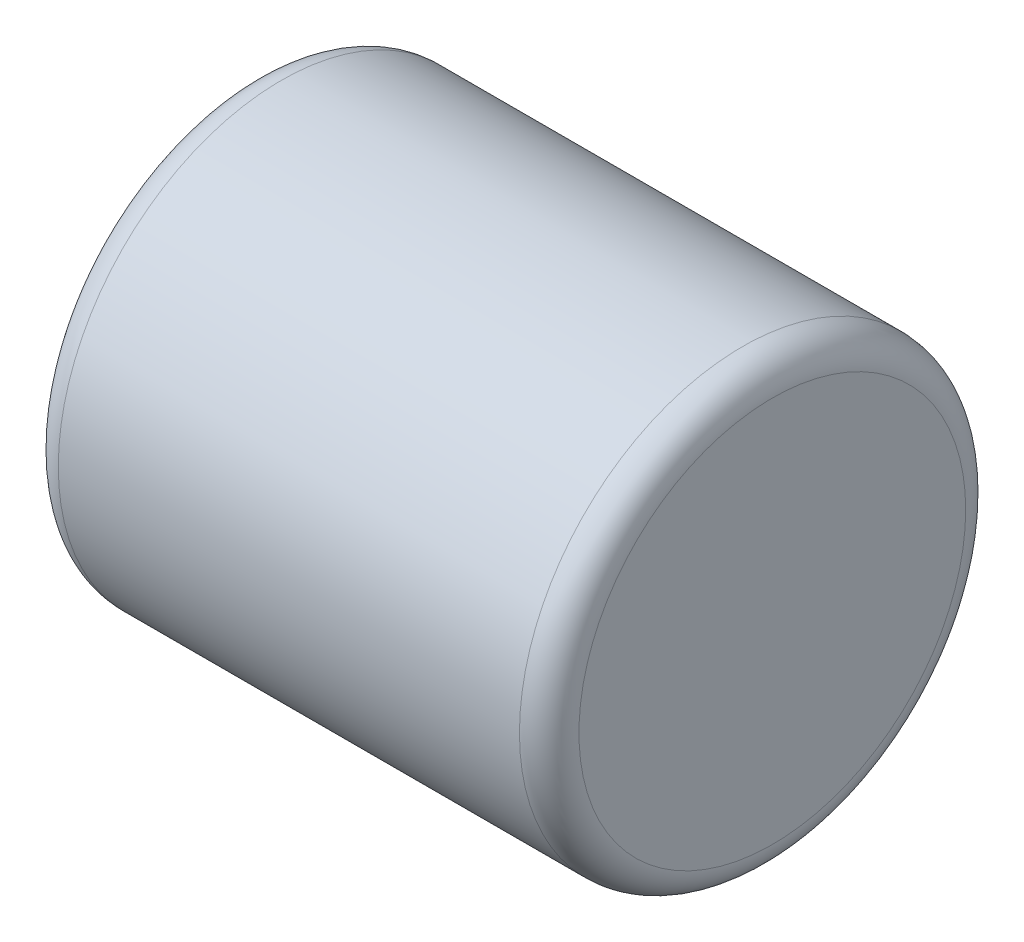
ISO-10303-21;
HEADER;
FILE_DESCRIPTION(('STEP AP214'),'2;1');
FILE_NAME('part.step','',(''),(''),'','','');
FILE_SCHEMA(('AUTOMOTIVE_DESIGN { 1 0 10303 214 1 1 1 1 }'));
ENDSEC;
DATA;
#1=APPLICATION_CONTEXT('core data for automotive mechanical design processes');
#2=APPLICATION_PROTOCOL_DEFINITION('international standard','automotive_design',2000,#1);
#3=PRODUCT_CONTEXT('',#1,'mechanical');
#4=PRODUCT('Part','Part','',(#3));
#5=PRODUCT_RELATED_PRODUCT_CATEGORY('part','',(#4));
#6=PRODUCT_DEFINITION_FORMATION('','',#4);
#7=PRODUCT_DEFINITION_CONTEXT('part definition',#1,'design');
#8=PRODUCT_DEFINITION('design','',#6,#7);
#9=PRODUCT_DEFINITION_SHAPE('','',#8);
#10=(LENGTH_UNIT() NAMED_UNIT(*) SI_UNIT(.MILLI.,.METRE.));
#11=(NAMED_UNIT(*) PLANE_ANGLE_UNIT() SI_UNIT($,.RADIAN.));
#12=(NAMED_UNIT(*) SI_UNIT($,.STERADIAN.) SOLID_ANGLE_UNIT());
#13=UNCERTAINTY_MEASURE_WITH_UNIT(LENGTH_MEASURE(1.E-05),#10,'distance_accuracy_value','');
#14=(GEOMETRIC_REPRESENTATION_CONTEXT(3) GLOBAL_UNCERTAINTY_ASSIGNED_CONTEXT((#13)) GLOBAL_UNIT_ASSIGNED_CONTEXT((#10,
#11,#12)) REPRESENTATION_CONTEXT('',''));
#15=CARTESIAN_POINT('',(0.,0.,0.));
#16=DIRECTION('',(0.,0.,1.));
#17=DIRECTION('',(1.,0.,0.));
#18=AXIS2_PLACEMENT_3D('',#15,#16,#17);
#19=CARTESIAN_POINT('',(0.,0.,0.));
#20=DIRECTION('',(-1.,0.,0.));
#21=DIRECTION('',(0.,0.,1.));
#22=AXIS2_PLACEMENT_3D('',#19,#20,#21);
#23=PLANE('',#22);
#24=CARTESIAN_POINT('',(0.,0.,0.));
#25=DIRECTION('',(-1.,0.,0.));
#26=DIRECTION('',(0.,0.,1.));
#27=AXIS2_PLACEMENT_3D('',#24,#25,#26);
#28=CIRCLE('',#27,1.3);
#29=CARTESIAN_POINT('',(0.,0.,1.3));
#30=VERTEX_POINT('',#29);
#31=EDGE_CURVE('E10',#30,#30,#28,.T.);
#32=ORIENTED_EDGE('',*,*,#31,.T.);
#33=EDGE_LOOP('',(#32));
#34=FACE_BOUND('',#33,.T.);
#35=ADVANCED_FACE('F29',(#34),#23,.T.);
#36=CARTESIAN_POINT('',(3.5,1.5,0.));
#37=DIRECTION('',(1.,0.,0.));
#38=DIRECTION('',(0.,0.,-1.));
#39=AXIS2_PLACEMENT_3D('',#36,#37,#38);
#40=PLANE('',#39);
#41=CARTESIAN_POINT('',(3.5,0.,0.));
#42=DIRECTION('',(1.,0.,0.));
#43=DIRECTION('',(0.,0.,-1.));
#44=AXIS2_PLACEMENT_3D('',#41,#42,#43);
#45=CIRCLE('',#44,1.3);
#46=CARTESIAN_POINT('',(3.5,0.,-1.3));
#47=VERTEX_POINT('',#46);
#48=EDGE_CURVE('E35',#47,#47,#45,.T.);
#49=ORIENTED_EDGE('',*,*,#48,.T.);
#50=EDGE_LOOP('',(#49));
#51=FACE_BOUND('',#50,.T.);
#52=ADVANCED_FACE('F62',(#51),#40,.T.);
#53=CARTESIAN_POINT('',(-2.5,0.,0.));
#54=DIRECTION('',(-1.,0.,0.));
#55=DIRECTION('',(0.,0.,1.));
#56=AXIS2_PLACEMENT_3D('',#53,#54,#55);
#57=CYLINDRICAL_SURFACE('',#56,1.5);
#58=CARTESIAN_POINT('',(3.3,0.,0.));
#59=DIRECTION('',(1.,0.,0.));
#60=DIRECTION('',(0.,0.,-1.));
#61=AXIS2_PLACEMENT_3D('',#58,#59,#60);
#62=CIRCLE('',#61,1.5);
#63=CARTESIAN_POINT('',(3.3,0.,-1.5));
#64=VERTEX_POINT('',#63);
#65=EDGE_CURVE('E39',#64,#64,#62,.F.);
#66=ORIENTED_EDGE('',*,*,#65,.T.);
#67=EDGE_LOOP('',(#66));
#68=FACE_BOUND('',#67,.T.);
#69=CARTESIAN_POINT('',(0.2,0.,0.));
#70=DIRECTION('',(-1.,0.,0.));
#71=DIRECTION('',(0.,0.,1.));
#72=AXIS2_PLACEMENT_3D('',#69,#70,#71);
#73=CIRCLE('',#72,1.5);
#74=CARTESIAN_POINT('',(0.2,0.,1.5));
#75=VERTEX_POINT('',#74);
#76=EDGE_CURVE('E43',#75,#75,#73,.F.);
#77=ORIENTED_EDGE('',*,*,#76,.T.);
#78=EDGE_LOOP('',(#77));
#79=FACE_BOUND('',#78,.T.);
#80=ADVANCED_FACE('F49',(#68,#79),#57,.T.);
#81=CARTESIAN_POINT('',(3.3,0.,0.));
#82=DIRECTION('',(1.,0.,0.));
#83=DIRECTION('',(0.,0.,-1.));
#84=AXIS2_PLACEMENT_3D('',#81,#82,#83);
#85=TOROIDAL_SURFACE('',#84,1.3,0.2);
#86=ORIENTED_EDGE('',*,*,#48,.F.);
#87=EDGE_LOOP('',(#86));
#88=FACE_BOUND('',#87,.T.);
#89=ORIENTED_EDGE('',*,*,#65,.F.);
#90=EDGE_LOOP('',(#89));
#91=FACE_BOUND('',#90,.T.);
#92=ADVANCED_FACE('F54',(#88,#91),#85,.T.);
#93=CARTESIAN_POINT('',(0.2,0.,0.));
#94=DIRECTION('',(-1.,0.,0.));
#95=DIRECTION('',(0.,0.,1.));
#96=AXIS2_PLACEMENT_3D('',#93,#94,#95);
#97=TOROIDAL_SURFACE('',#96,1.3,0.2);
#98=ORIENTED_EDGE('',*,*,#76,.F.);
#99=EDGE_LOOP('',(#98));
#100=FACE_BOUND('',#99,.T.);
#101=ORIENTED_EDGE('',*,*,#31,.F.);
#102=EDGE_LOOP('',(#101));
#103=FACE_BOUND('',#102,.T.);
#104=ADVANCED_FACE('F51',(#100,#103),#97,.T.);
#105=CLOSED_SHELL('',(#35,#52,#80,#92,#104));
#106=MANIFOLD_SOLID_BREP('B2',#105);
#107=ADVANCED_BREP_SHAPE_REPRESENTATION('',(#18,#106),#14);
#108=SHAPE_DEFINITION_REPRESENTATION(#9,#107);
ENDSEC;
END-ISO-10303-21;
